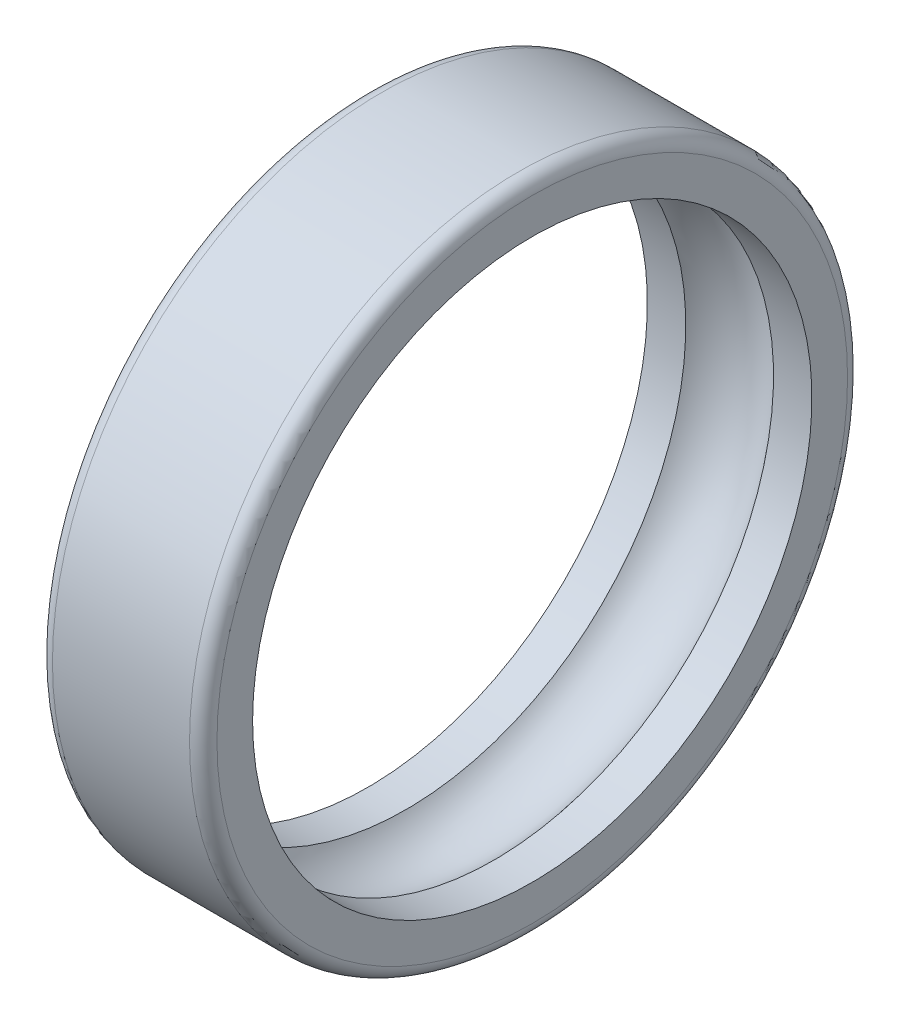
ISO-10303-21;
HEADER;
FILE_DESCRIPTION(('STEP AP214'),'2;1');
FILE_NAME('part.step','',(''),(''),'','','');
FILE_SCHEMA(('AUTOMOTIVE_DESIGN { 1 0 10303 214 1 1 1 1 }'));
ENDSEC;
DATA;
#1=APPLICATION_CONTEXT('core data for automotive mechanical design processes');
#2=APPLICATION_PROTOCOL_DEFINITION('international standard','automotive_design',2000,#1);
#3=PRODUCT_CONTEXT('',#1,'mechanical');
#4=PRODUCT('Part','Part','',(#3));
#5=PRODUCT_RELATED_PRODUCT_CATEGORY('part','',(#4));
#6=PRODUCT_DEFINITION_FORMATION('','',#4);
#7=PRODUCT_DEFINITION_CONTEXT('part definition',#1,'design');
#8=PRODUCT_DEFINITION('design','',#6,#7);
#9=PRODUCT_DEFINITION_SHAPE('','',#8);
#10=(LENGTH_UNIT() NAMED_UNIT(*) SI_UNIT(.MILLI.,.METRE.));
#11=(NAMED_UNIT(*) PLANE_ANGLE_UNIT() SI_UNIT($,.RADIAN.));
#12=(NAMED_UNIT(*) SI_UNIT($,.STERADIAN.) SOLID_ANGLE_UNIT());
#13=UNCERTAINTY_MEASURE_WITH_UNIT(LENGTH_MEASURE(1.E-05),#10,'distance_accuracy_value','');
#14=(GEOMETRIC_REPRESENTATION_CONTEXT(3) GLOBAL_UNCERTAINTY_ASSIGNED_CONTEXT((#13)) GLOBAL_UNIT_ASSIGNED_CONTEXT((#10,
#11,#12)) REPRESENTATION_CONTEXT('',''));
#15=CARTESIAN_POINT('',(0.,0.,0.));
#16=DIRECTION('',(0.,0.,1.));
#17=DIRECTION('',(1.,0.,0.));
#18=AXIS2_PLACEMENT_3D('',#15,#16,#17);
#19=CARTESIAN_POINT('',(3.,11.5,0.));
#20=DIRECTION('',(-1.,0.,0.));
#21=DIRECTION('',(0.,0.,1.));
#22=AXIS2_PLACEMENT_3D('',#19,#20,#21);
#23=PLANE('',#22);
#24=CARTESIAN_POINT('',(3.,0.,0.));
#25=DIRECTION('',(-1.,0.,0.));
#26=DIRECTION('',(0.,0.,1.));
#27=AXIS2_PLACEMENT_3D('',#24,#25,#26);
#28=CIRCLE('',#27,11.5);
#29=CARTESIAN_POINT('',(3.,0.,11.5));
#30=VERTEX_POINT('',#29);
#31=EDGE_CURVE('E10',#30,#30,#28,.T.);
#32=ORIENTED_EDGE('',*,*,#31,.F.);
#33=EDGE_LOOP('',(#32));
#34=FACE_BOUND('',#33,.T.);
#35=CARTESIAN_POINT('',(3.,0.,0.));
#36=DIRECTION('',(-1.,0.,0.));
#37=DIRECTION('',(0.,0.,1.));
#38=AXIS2_PLACEMENT_3D('',#35,#36,#37);
#39=CIRCLE('',#38,10.2);
#40=CARTESIAN_POINT('',(3.,0.,10.2));
#41=VERTEX_POINT('',#40);
#42=EDGE_CURVE('E60',#41,#41,#39,.T.);
#43=ORIENTED_EDGE('',*,*,#42,.T.);
#44=EDGE_LOOP('',(#43));
#45=FACE_BOUND('',#44,.T.);
#46=ADVANCED_FACE('F32',(#34,#45),#23,.F.);
#47=CARTESIAN_POINT('',(2.5,0.,0.));
#48=DIRECTION('',(-1.,0.,0.));
#49=DIRECTION('',(0.,0.,1.));
#50=AXIS2_PLACEMENT_3D('',#47,#48,#49);
#51=TOROIDAL_SURFACE('',#50,11.5,0.5);
#52=CARTESIAN_POINT('',(2.5,0.,0.));
#53=DIRECTION('',(-1.,0.,0.));
#54=DIRECTION('',(0.,0.,1.));
#55=AXIS2_PLACEMENT_3D('',#52,#53,#54);
#56=CIRCLE('',#55,12.);
#57=CARTESIAN_POINT('',(2.5,0.,12.));
#58=VERTEX_POINT('',#57);
#59=EDGE_CURVE('E38',#58,#58,#56,.T.);
#60=ORIENTED_EDGE('',*,*,#59,.F.);
#61=EDGE_LOOP('',(#60));
#62=FACE_BOUND('',#61,.T.);
#63=ORIENTED_EDGE('',*,*,#31,.T.);
#64=EDGE_LOOP('',(#63));
#65=FACE_BOUND('',#64,.T.);
#66=ADVANCED_FACE('F97',(#62,#65),#51,.T.);
#67=CARTESIAN_POINT('',(-4.37090809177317,0.,0.));
#68=DIRECTION('',(-1.,0.,0.));
#69=DIRECTION('',(0.,0.,1.));
#70=AXIS2_PLACEMENT_3D('',#67,#68,#69);
#71=CYLINDRICAL_SURFACE('',#70,12.);
#72=CARTESIAN_POINT('',(-2.5,0.,0.));
#73=DIRECTION('',(-1.,0.,0.));
#74=DIRECTION('',(0.,0.,1.));
#75=AXIS2_PLACEMENT_3D('',#72,#73,#74);
#76=CIRCLE('',#75,12.);
#77=CARTESIAN_POINT('',(-2.5,0.,12.));
#78=VERTEX_POINT('',#77);
#79=EDGE_CURVE('E42',#78,#78,#76,.T.);
#80=ORIENTED_EDGE('',*,*,#79,.F.);
#81=EDGE_LOOP('',(#80));
#82=FACE_BOUND('',#81,.T.);
#83=ORIENTED_EDGE('',*,*,#59,.T.);
#84=EDGE_LOOP('',(#83));
#85=FACE_BOUND('',#84,.T.);
#86=ADVANCED_FACE('F92',(#82,#85),#71,.T.);
#87=CARTESIAN_POINT('',(-2.5,0.,0.));
#88=DIRECTION('',(-1.,0.,0.));
#89=DIRECTION('',(0.,0.,1.));
#90=AXIS2_PLACEMENT_3D('',#87,#88,#89);
#91=TOROIDAL_SURFACE('',#90,11.5,0.5);
#92=CARTESIAN_POINT('',(-3.,0.,0.));
#93=DIRECTION('',(-1.,0.,0.));
#94=DIRECTION('',(0.,0.,1.));
#95=AXIS2_PLACEMENT_3D('',#92,#93,#94);
#96=CIRCLE('',#95,11.5);
#97=CARTESIAN_POINT('',(-3.,0.,11.5));
#98=VERTEX_POINT('',#97);
#99=EDGE_CURVE('E46',#98,#98,#96,.T.);
#100=ORIENTED_EDGE('',*,*,#99,.F.);
#101=EDGE_LOOP('',(#100));
#102=FACE_BOUND('',#101,.T.);
#103=ORIENTED_EDGE('',*,*,#79,.T.);
#104=EDGE_LOOP('',(#103));
#105=FACE_BOUND('',#104,.T.);
#106=ADVANCED_FACE('F86',(#102,#105),#91,.T.);
#107=CARTESIAN_POINT('',(-3.,11.5,0.));
#108=DIRECTION('',(1.,0.,0.));
#109=DIRECTION('',(0.,0.,-1.));
#110=AXIS2_PLACEMENT_3D('',#107,#108,#109);
#111=PLANE('',#110);
#112=CARTESIAN_POINT('',(-3.,0.,0.));
#113=DIRECTION('',(-1.,0.,0.));
#114=DIRECTION('',(0.,0.,1.));
#115=AXIS2_PLACEMENT_3D('',#112,#113,#114);
#116=CIRCLE('',#115,10.2);
#117=CARTESIAN_POINT('',(-3.,0.,10.2));
#118=VERTEX_POINT('',#117);
#119=EDGE_CURVE('E51',#118,#118,#116,.T.);
#120=ORIENTED_EDGE('',*,*,#119,.F.);
#121=EDGE_LOOP('',(#120));
#122=FACE_BOUND('',#121,.T.);
#123=ORIENTED_EDGE('',*,*,#99,.T.);
#124=EDGE_LOOP('',(#123));
#125=FACE_BOUND('',#124,.T.);
#126=ADVANCED_FACE('F80',(#122,#125),#111,.F.);
#127=CARTESIAN_POINT('',(-4.37090809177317,0.,0.));
#128=DIRECTION('',(-1.,0.,0.));
#129=DIRECTION('',(0.,0.,1.));
#130=AXIS2_PLACEMENT_3D('',#127,#128,#129);
#131=CYLINDRICAL_SURFACE('',#130,10.2);
#132=CARTESIAN_POINT('',(-1.6,0.,0.));
#133=DIRECTION('',(-1.,0.,0.));
#134=DIRECTION('',(0.,0.,1.));
#135=AXIS2_PLACEMENT_3D('',#132,#133,#134);
#136=CIRCLE('',#135,10.2);
#137=CARTESIAN_POINT('',(-1.6,0.,10.2));
#138=VERTEX_POINT('',#137);
#139=EDGE_CURVE('E54',#138,#138,#136,.T.);
#140=ORIENTED_EDGE('',*,*,#139,.F.);
#141=EDGE_LOOP('',(#140));
#142=FACE_BOUND('',#141,.T.);
#143=ORIENTED_EDGE('',*,*,#119,.T.);
#144=EDGE_LOOP('',(#143));
#145=FACE_BOUND('',#144,.T.);
#146=ADVANCED_FACE('F74',(#142,#145),#131,.F.);
#147=CARTESIAN_POINT('',(0.,0.,0.));
#148=DIRECTION('',(-1.,0.,0.));
#149=DIRECTION('',(0.,0.,1.));
#150=AXIS2_PLACEMENT_3D('',#147,#148,#149);
#151=TOROIDAL_SURFACE('',#150,9.,2.);
#152=CARTESIAN_POINT('',(1.6,0.,0.));
#153=DIRECTION('',(-1.,0.,0.));
#154=DIRECTION('',(0.,0.,1.));
#155=AXIS2_PLACEMENT_3D('',#152,#153,#154);
#156=CIRCLE('',#155,10.2);
#157=CARTESIAN_POINT('',(1.6,0.,10.2));
#158=VERTEX_POINT('',#157);
#159=EDGE_CURVE('E57',#158,#158,#156,.T.);
#160=ORIENTED_EDGE('',*,*,#159,.F.);
#161=EDGE_LOOP('',(#160));
#162=FACE_BOUND('',#161,.T.);
#163=ORIENTED_EDGE('',*,*,#139,.T.);
#164=EDGE_LOOP('',(#163));
#165=FACE_BOUND('',#164,.T.);
#166=ADVANCED_FACE('F68',(#162,#165),#151,.F.);
#167=CARTESIAN_POINT('',(-4.37090809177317,0.,0.));
#168=DIRECTION('',(-1.,0.,0.));
#169=DIRECTION('',(0.,0.,1.));
#170=AXIS2_PLACEMENT_3D('',#167,#168,#169);
#171=CYLINDRICAL_SURFACE('',#170,10.2);
#172=ORIENTED_EDGE('',*,*,#42,.F.);
#173=EDGE_LOOP('',(#172));
#174=FACE_BOUND('',#173,.T.);
#175=ORIENTED_EDGE('',*,*,#159,.T.);
#176=EDGE_LOOP('',(#175));
#177=FACE_BOUND('',#176,.T.);
#178=ADVANCED_FACE('F65',(#174,#177),#171,.F.);
#179=CLOSED_SHELL('',(#46,#66,#86,#106,#126,#146,#166,#178));
#180=MANIFOLD_SOLID_BREP('B2',#179);
#181=ADVANCED_BREP_SHAPE_REPRESENTATION('',(#18,#180),#14);
#182=SHAPE_DEFINITION_REPRESENTATION(#9,#181);
ENDSEC;
END-ISO-10303-21;
